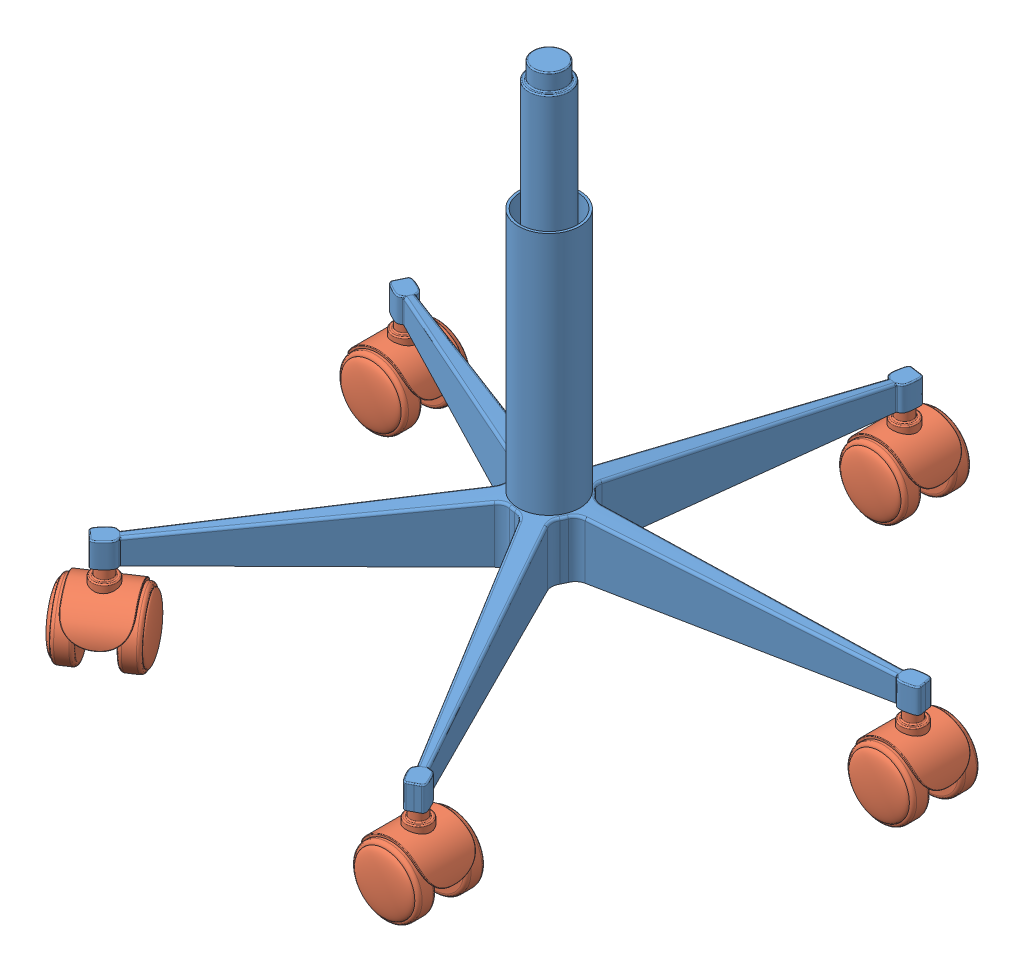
SolidWorks assembly noge_ass.SLDASM, configuration Default (file format 4700). Lengths in mm.
Overall size (546.09 424.33 547.79).
6 component instances, 2 part files, 10 mates.
Components (placement in the parent):
- noge5-1: noge5.SLDPRT [Default] at (-32.5019 -25.4626 34.4497) size (506.04 353.78 503.49)
- wheel_ch-1: wheel_ch.SLDPRT [Default] at (-222.1443 -68.5108 226.5) x (0.554353 0 0.832281) z (-0.832281 0 0.554353) size (60.82 70.55 65)
- wheel_ch-2: wheel_ch.SLDPRT [Default] at (-263.9502 -68.5108 -66.3111) size (60.82 70.55 65)
- wheel_ch-3: wheel_ch.SLDPRT [Default] at (3.6941 -68.5108 -208.1701) size (60.82 70.55 65)
- wheel_ch-4: wheel_ch.SLDPRT [Default] at (221.3166 -68.5108 2.5378) size (60.82 70.55 65)
- wheel_ch-5: wheel_ch.SLDPRT [Default] at (88.1705 -68.5108 274.6215) size (60.82 70.55 65)
Mates (geometry in assembly coordinates):
- Concentric1: concentric aligned: circle of noge5-1; circle of wheel_ch-1
- Coincident1: coincident anti-aligned: plane of noge5-1 through (-468.0495 -25.4626 31.9528) normal (0 -1 0); plane of wheel_ch-1 through (-208.5803 -25.4626 224.3156) normal (0 1 0)
- Concentric2: concentric aligned: circle of noge5-1; circle of wheel_ch-2
- Coincident2: coincident anti-aligned: plane of noge5-1 through (-468.0495 -25.4626 31.9528) normal (0 -1 0); plane of wheel_ch-2 through (-258.2489 -25.4626 -78.8111) normal (0 1 0)
- Concentric3: concentric aligned: circle of noge5-1; circle of wheel_ch-3
- Coincident3: coincident anti-aligned: plane of noge5-1 through (-468.0495 -25.4626 31.9528) normal (0 -1 0); plane of wheel_ch-3 through (9.3953 -25.4626 -220.6701) normal (0 1 0)
- Concentric4: concentric aligned: circle of noge5-1; circle of wheel_ch-4
- Coincident4: coincident anti-aligned: plane of noge5-1 through (-468.0495 -25.4626 31.9528) normal (0 -1 0); plane of wheel_ch-4 through (227.0179 -25.4626 -9.9622) normal (0 1 0)
- Concentric5: concentric aligned: circle of noge5-1; circle of wheel_ch-5
- Coincident5: coincident anti-aligned: plane of noge5-1 through (-468.0495 -25.4626 31.9528) normal (0 -1 0); plane of wheel_ch-5 through (93.8718 -25.4626 262.1215) normal (0 1 0)
